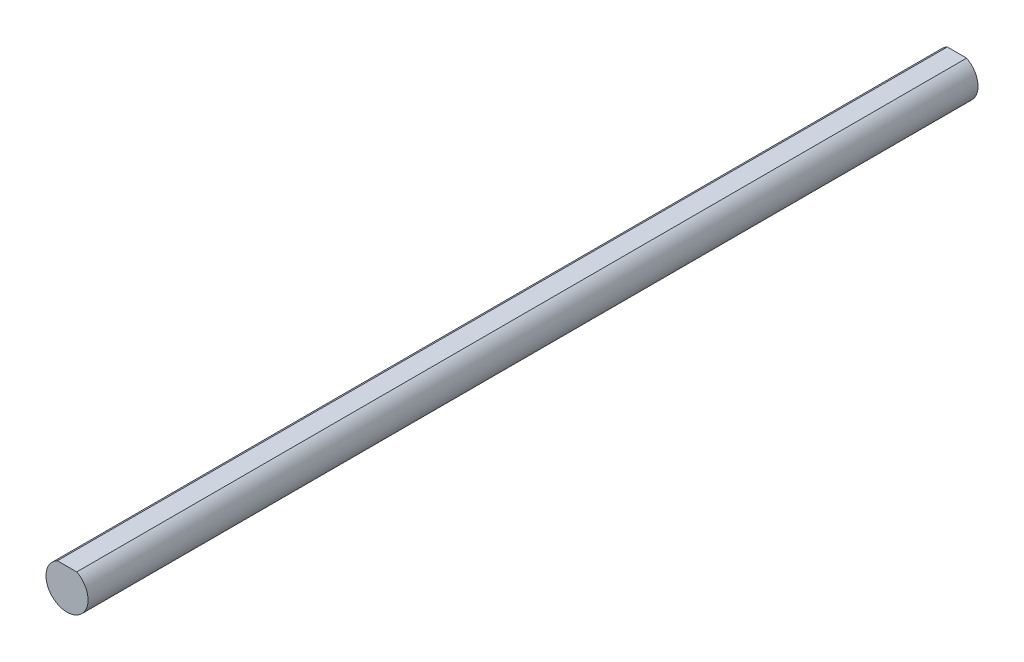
from build123d import *

# Parameters (mm, degrees)
EXTRUDE1_DEPTH = 100


with BuildPart() as part:
    # Sketch1 → Extrude1 (new body)
    with BuildSketch(Plane.XY):
        with BuildLine():
            Line((-1.087761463, 2.1), (1.087761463, 2.1))
            ThreePointArc((1.087761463, 2.1), (0, -2.365), (-1.087761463, 2.1))
        make_face()
    extrude(amount=-EXTRUDE1_DEPTH)


solid = part.part
